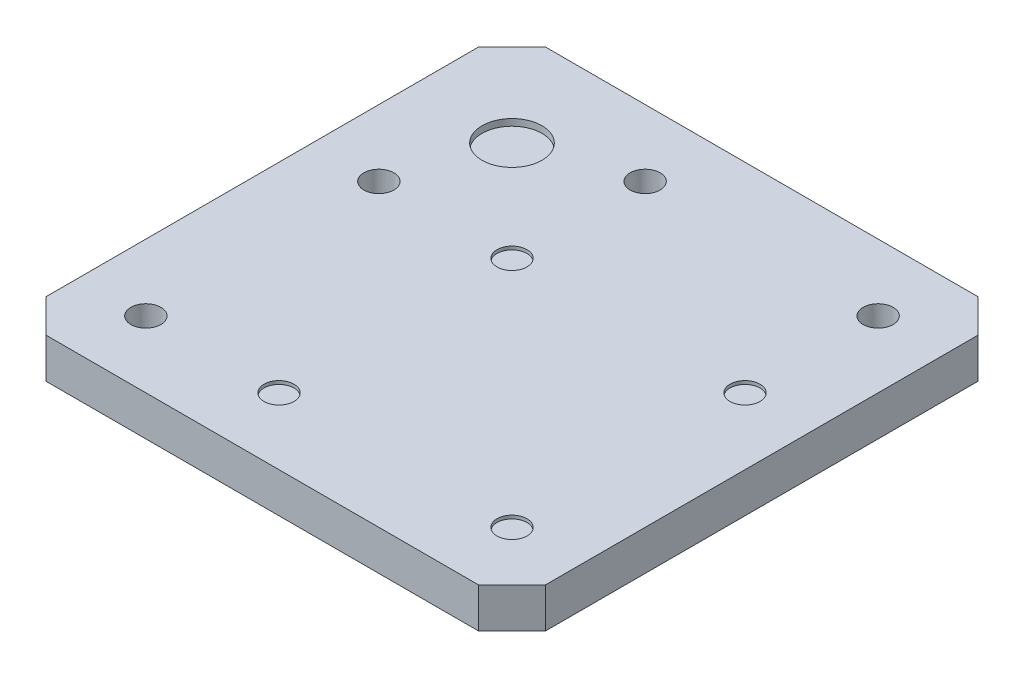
ISO-10303-21;
HEADER;
FILE_DESCRIPTION(('STEP AP214'),'2;1');
FILE_NAME('part.step','',(''),(''),'','','');
FILE_SCHEMA(('AUTOMOTIVE_DESIGN { 1 0 10303 214 1 1 1 1 }'));
ENDSEC;
DATA;
#1=APPLICATION_CONTEXT('core data for automotive mechanical design processes');
#2=APPLICATION_PROTOCOL_DEFINITION('international standard','automotive_design',2000,#1);
#3=PRODUCT_CONTEXT('',#1,'mechanical');
#4=PRODUCT('Part','Part','',(#3));
#5=PRODUCT_RELATED_PRODUCT_CATEGORY('part','',(#4));
#6=PRODUCT_DEFINITION_FORMATION('','',#4);
#7=PRODUCT_DEFINITION_CONTEXT('part definition',#1,'design');
#8=PRODUCT_DEFINITION('design','',#6,#7);
#9=PRODUCT_DEFINITION_SHAPE('','',#8);
#10=(LENGTH_UNIT() NAMED_UNIT(*) SI_UNIT(.MILLI.,.METRE.));
#11=(NAMED_UNIT(*) PLANE_ANGLE_UNIT() SI_UNIT($,.RADIAN.));
#12=(NAMED_UNIT(*) SI_UNIT($,.STERADIAN.) SOLID_ANGLE_UNIT());
#13=UNCERTAINTY_MEASURE_WITH_UNIT(LENGTH_MEASURE(1.E-05),#10,'distance_accuracy_value','');
#14=(GEOMETRIC_REPRESENTATION_CONTEXT(3) GLOBAL_UNCERTAINTY_ASSIGNED_CONTEXT((#13)) GLOBAL_UNIT_ASSIGNED_CONTEXT((#10,
#11,#12)) REPRESENTATION_CONTEXT('',''));
#15=CARTESIAN_POINT('',(0.,0.,0.));
#16=DIRECTION('',(0.,0.,1.));
#17=DIRECTION('',(1.,0.,0.));
#18=AXIS2_PLACEMENT_3D('',#15,#16,#17);
#19=CARTESIAN_POINT('',(-36.,-14.,-45.));
#20=DIRECTION('',(0.,1.,0.));
#21=DIRECTION('',(0.,0.,1.));
#22=AXIS2_PLACEMENT_3D('',#19,#20,#21);
#23=PLANE('',#22);
#24=CARTESIAN_POINT('',(-45.,-14.,-45.));
#25=DIRECTION('',(0.,1.,0.));
#26=DIRECTION('',(0.,0.,1.));
#27=AXIS2_PLACEMENT_3D('',#24,#25,#26);
#28=CIRCLE('',#27,8.99999999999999);
#29=CARTESIAN_POINT('',(-45.,-14.,-36.));
#30=VERTEX_POINT('',#29);
#31=EDGE_CURVE('E20',#30,#30,#28,.F.);
#32=ORIENTED_EDGE('',*,*,#31,.T.);
#33=EDGE_LOOP('',(#32));
#34=FACE_BOUND('',#33,.T.);
#35=ADVANCED_FACE('F17',(#34),#23,.F.);
#36=CARTESIAN_POINT('',(-45.,-64.25,-45.));
#37=DIRECTION('',(0.,1.,0.));
#38=DIRECTION('',(0.,0.,1.));
#39=AXIS2_PLACEMENT_3D('',#36,#37,#38);
#40=CYLINDRICAL_SURFACE('',#39,8.99999999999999);
#41=CARTESIAN_POINT('',(-45.,-64.25,-45.));
#42=DIRECTION('',(0.,1.,0.));
#43=DIRECTION('',(0.,0.,1.));
#44=AXIS2_PLACEMENT_3D('',#41,#42,#43);
#45=CIRCLE('',#44,8.99999999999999);
#46=CARTESIAN_POINT('',(-45.,-64.25,-36.));
#47=VERTEX_POINT('',#46);
#48=EDGE_CURVE('E171',#47,#47,#45,.F.);
#49=ORIENTED_EDGE('',*,*,#48,.T.);
#50=EDGE_LOOP('',(#49));
#51=FACE_BOUND('',#50,.T.);
#52=ORIENTED_EDGE('',*,*,#31,.F.);
#53=EDGE_LOOP('',(#52));
#54=FACE_BOUND('',#53,.T.);
#55=ADVANCED_FACE('F179',(#51,#54),#40,.F.);
#56=CARTESIAN_POINT('',(-30.,-64.25,-45.));
#57=DIRECTION('',(0.,1.,0.));
#58=DIRECTION('',(0.,0.,1.));
#59=AXIS2_PLACEMENT_3D('',#56,#57,#58);
#60=PLANE('',#59);
#61=ORIENTED_EDGE('',*,*,#48,.F.);
#62=EDGE_LOOP('',(#61));
#63=FACE_BOUND('',#62,.T.);
#64=CARTESIAN_POINT('',(-45.,-64.25,-45.));
#65=DIRECTION('',(0.,1.,0.));
#66=DIRECTION('',(0.,0.,1.));
#67=AXIS2_PLACEMENT_3D('',#64,#65,#66);
#68=CIRCLE('',#67,15.);
#69=CARTESIAN_POINT('',(-45.,-64.25,-30.));
#70=VERTEX_POINT('',#69);
#71=EDGE_CURVE('E114',#70,#70,#68,.T.);
#72=ORIENTED_EDGE('',*,*,#71,.F.);
#73=EDGE_LOOP('',(#72));
#74=FACE_BOUND('',#73,.T.);
#75=ADVANCED_FACE('F181',(#63,#74),#60,.F.);
#76=CARTESIAN_POINT('',(-45.,-61.25,-45.));
#77=DIRECTION('',(0.,1.,0.));
#78=DIRECTION('',(0.,0.,1.));
#79=AXIS2_PLACEMENT_3D('',#76,#77,#78);
#80=CONICAL_SURFACE('',#79,18.,0.785398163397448);
#81=ORIENTED_EDGE('',*,*,#71,.T.);
#82=EDGE_LOOP('',(#81));
#83=FACE_BOUND('',#82,.T.);
#84=CARTESIAN_POINT('',(-45.,-61.25,-45.));
#85=DIRECTION('',(0.,1.,0.));
#86=DIRECTION('',(0.,0.,1.));
#87=AXIS2_PLACEMENT_3D('',#84,#85,#86);
#88=CIRCLE('',#87,18.);
#89=CARTESIAN_POINT('',(-45.,-61.25,-27.));
#90=VERTEX_POINT('',#89);
#91=EDGE_CURVE('E112',#90,#90,#88,.T.);
#92=ORIENTED_EDGE('',*,*,#91,.F.);
#93=EDGE_LOOP('',(#92));
#94=FACE_BOUND('',#93,.T.);
#95=ADVANCED_FACE('F187',(#83,#94),#80,.T.);
#96=CARTESIAN_POINT('',(-45.,-64.25,-45.));
#97=DIRECTION('',(0.,1.,0.));
#98=DIRECTION('',(0.,0.,1.));
#99=AXIS2_PLACEMENT_3D('',#96,#97,#98);
#100=CYLINDRICAL_SURFACE('',#99,18.);
#101=ORIENTED_EDGE('',*,*,#91,.T.);
#102=EDGE_LOOP('',(#101));
#103=FACE_BOUND('',#102,.T.);
#104=CARTESIAN_POINT('',(-45.,-14.,-45.));
#105=DIRECTION('',(0.,1.,0.));
#106=DIRECTION('',(0.,0.,1.));
#107=AXIS2_PLACEMENT_3D('',#104,#105,#106);
#108=CIRCLE('',#107,18.);
#109=CARTESIAN_POINT('',(-45.,-14.,-27.));
#110=VERTEX_POINT('',#109);
#111=EDGE_CURVE('E108',#110,#110,#108,.T.);
#112=ORIENTED_EDGE('',*,*,#111,.F.);
#113=EDGE_LOOP('',(#112));
#114=FACE_BOUND('',#113,.T.);
#115=ADVANCED_FACE('F287',(#103,#114),#100,.T.);
#116=CARTESIAN_POINT('',(-45.,-12.,-45.));
#117=DIRECTION('',(0.,1.,0.));
#118=DIRECTION('',(-1.,0.,0.));
#119=AXIS2_PLACEMENT_3D('',#116,#117,#118);
#120=CONICAL_SURFACE('',#119,20.,0.785398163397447);
#121=ORIENTED_EDGE('',*,*,#111,.T.);
#122=EDGE_LOOP('',(#121));
#123=FACE_BOUND('',#122,.T.);
#124=CARTESIAN_POINT('',(-45.,-12.,-45.));
#125=DIRECTION('',(0.,1.,0.));
#126=DIRECTION('',(-1.,0.,0.));
#127=AXIS2_PLACEMENT_3D('',#124,#125,#126);
#128=CIRCLE('',#127,20.);
#129=CARTESIAN_POINT('',(-65.,-12.,-45.));
#130=VERTEX_POINT('',#129);
#131=EDGE_CURVE('E111',#130,#130,#128,.F.);
#132=ORIENTED_EDGE('',*,*,#131,.T.);
#133=EDGE_LOOP('',(#132));
#134=FACE_BOUND('',#133,.T.);
#135=ADVANCED_FACE('F283',(#123,#134),#120,.T.);
#136=CARTESIAN_POINT('',(0.,-1.,0.));
#137=DIRECTION('',(0.,1.,0.));
#138=DIRECTION('',(0.,0.,1.));
#139=AXIS2_PLACEMENT_3D('',#136,#137,#138);
#140=PLANE('',#139);
#141=CARTESIAN_POINT('',(-15.,-1.,-15.));
#142=DIRECTION('',(0.,-1.,0.));
#143=DIRECTION('',(0.,0.,-1.));
#144=AXIS2_PLACEMENT_3D('',#141,#142,#143);
#145=CIRCLE('',#144,4.5);
#146=CARTESIAN_POINT('',(-15.,-1.,-19.5));
#147=VERTEX_POINT('',#146);
#148=EDGE_CURVE('E162',#147,#147,#145,.F.);
#149=ORIENTED_EDGE('',*,*,#148,.T.);
#150=EDGE_LOOP('',(#149));
#151=FACE_BOUND('',#150,.T.);
#152=ADVANCED_FACE('F279',(#151),#140,.T.);
#153=CARTESIAN_POINT('',(0.,-1.,0.));
#154=DIRECTION('',(0.,1.,0.));
#155=DIRECTION('',(0.,0.,1.));
#156=AXIS2_PLACEMENT_3D('',#153,#154,#155);
#157=PLANE('',#156);
#158=CARTESIAN_POINT('',(55.,-1.,55.));
#159=DIRECTION('',(0.,-1.,0.));
#160=DIRECTION('',(0.,0.,-1.));
#161=AXIS2_PLACEMENT_3D('',#158,#159,#160);
#162=CIRCLE('',#161,4.5);
#163=CARTESIAN_POINT('',(55.,-1.,50.5));
#164=VERTEX_POINT('',#163);
#165=EDGE_CURVE('E93',#164,#164,#162,.F.);
#166=ORIENTED_EDGE('',*,*,#165,.T.);
#167=EDGE_LOOP('',(#166));
#168=FACE_BOUND('',#167,.T.);
#169=ADVANCED_FACE('F275',(#168),#157,.T.);
#170=CARTESIAN_POINT('',(0.,-1.,0.));
#171=DIRECTION('',(0.,1.,0.));
#172=DIRECTION('',(0.,0.,1.));
#173=AXIS2_PLACEMENT_3D('',#170,#171,#172);
#174=PLANE('',#173);
#175=CARTESIAN_POINT('',(55.,-1.,-15.));
#176=DIRECTION('',(0.,-1.,0.));
#177=DIRECTION('',(0.,0.,-1.));
#178=AXIS2_PLACEMENT_3D('',#175,#176,#177);
#179=CIRCLE('',#178,4.5);
#180=CARTESIAN_POINT('',(55.,-1.,-19.5));
#181=VERTEX_POINT('',#180);
#182=EDGE_CURVE('E150',#181,#181,#179,.F.);
#183=ORIENTED_EDGE('',*,*,#182,.T.);
#184=EDGE_LOOP('',(#183));
#185=FACE_BOUND('',#184,.T.);
#186=ADVANCED_FACE('F271',(#185),#174,.T.);
#187=CARTESIAN_POINT('',(0.,-1.,0.));
#188=DIRECTION('',(0.,1.,0.));
#189=DIRECTION('',(0.,0.,1.));
#190=AXIS2_PLACEMENT_3D('',#187,#188,#189);
#191=PLANE('',#190);
#192=CARTESIAN_POINT('',(-15.,-1.,55.));
#193=DIRECTION('',(0.,-1.,0.));
#194=DIRECTION('',(0.,0.,-1.));
#195=AXIS2_PLACEMENT_3D('',#192,#193,#194);
#196=CIRCLE('',#195,4.5);
#197=CARTESIAN_POINT('',(-15.,-1.,50.5));
#198=VERTEX_POINT('',#197);
#199=EDGE_CURVE('E147',#198,#198,#196,.F.);
#200=ORIENTED_EDGE('',*,*,#199,.T.);
#201=EDGE_LOOP('',(#200));
#202=FACE_BOUND('',#201,.T.);
#203=ADVANCED_FACE('F267',(#202),#191,.T.);
#204=CARTESIAN_POINT('',(-45.,-2.,-45.));
#205=DIRECTION('',(0.,-1.,0.));
#206=DIRECTION('',(0.,0.,-1.));
#207=AXIS2_PLACEMENT_3D('',#204,#205,#206);
#208=PLANE('',#207);
#209=CARTESIAN_POINT('',(-45.,-2.,-45.));
#210=DIRECTION('',(0.,1.,0.));
#211=DIRECTION('',(0.,0.,1.));
#212=AXIS2_PLACEMENT_3D('',#209,#210,#211);
#213=CIRCLE('',#212,9.);
#214=CARTESIAN_POINT('',(-45.,-2.,-36.));
#215=VERTEX_POINT('',#214);
#216=EDGE_CURVE('E144',#215,#215,#213,.T.);
#217=ORIENTED_EDGE('',*,*,#216,.T.);
#218=EDGE_LOOP('',(#217));
#219=FACE_BOUND('',#218,.T.);
#220=ADVANCED_FACE('F263',(#219),#208,.F.);
#221=CARTESIAN_POINT('',(0.,-12.,0.));
#222=DIRECTION('',(0.,1.,0.));
#223=DIRECTION('',(0.,0.,1.));
#224=AXIS2_PLACEMENT_3D('',#221,#222,#223);
#225=PLANE('',#224);
#226=ORIENTED_EDGE('',*,*,#131,.F.);
#227=EDGE_LOOP('',(#226));
#228=FACE_BOUND('',#227,.T.);
#229=CARTESIAN_POINT('',(-55.,-12.,-15.));
#230=DIRECTION('',(0.,1.,0.));
#231=DIRECTION('',(0.,0.,1.));
#232=AXIS2_PLACEMENT_3D('',#229,#230,#231);
#233=CIRCLE('',#232,4.5);
#234=CARTESIAN_POINT('',(-55.,-12.,-10.5));
#235=VERTEX_POINT('',#234);
#236=EDGE_CURVE('E141',#235,#235,#233,.T.);
#237=ORIENTED_EDGE('',*,*,#236,.T.);
#238=EDGE_LOOP('',(#237));
#239=FACE_BOUND('',#238,.T.);
#240=CARTESIAN_POINT('',(-55.,-12.,55.));
#241=DIRECTION('',(0.,1.,0.));
#242=DIRECTION('',(0.,0.,1.));
#243=AXIS2_PLACEMENT_3D('',#240,#241,#242);
#244=CIRCLE('',#243,4.5);
#245=CARTESIAN_POINT('',(-55.,-12.,59.5));
#246=VERTEX_POINT('',#245);
#247=EDGE_CURVE('E165',#246,#246,#244,.T.);
#248=ORIENTED_EDGE('',*,*,#247,.T.);
#249=EDGE_LOOP('',(#248));
#250=FACE_BOUND('',#249,.T.);
#251=CARTESIAN_POINT('',(-15.,-12.,-55.));
#252=DIRECTION('',(0.,1.,0.));
#253=DIRECTION('',(0.,0.,1.));
#254=AXIS2_PLACEMENT_3D('',#251,#252,#253);
#255=CIRCLE('',#254,4.5);
#256=CARTESIAN_POINT('',(-15.,-12.,-50.5));
#257=VERTEX_POINT('',#256);
#258=EDGE_CURVE('E159',#257,#257,#255,.T.);
#259=ORIENTED_EDGE('',*,*,#258,.T.);
#260=EDGE_LOOP('',(#259));
#261=FACE_BOUND('',#260,.T.);
#262=CARTESIAN_POINT('',(55.,-12.,-55.));
#263=DIRECTION('',(0.,1.,0.));
#264=DIRECTION('',(0.,0.,1.));
#265=AXIS2_PLACEMENT_3D('',#262,#263,#264);
#266=CIRCLE('',#265,4.5);
#267=CARTESIAN_POINT('',(55.,-12.,-50.5));
#268=VERTEX_POINT('',#267);
#269=EDGE_CURVE('E153',#268,#268,#266,.T.);
#270=ORIENTED_EDGE('',*,*,#269,.T.);
#271=EDGE_LOOP('',(#270));
#272=FACE_BOUND('',#271,.T.);
#273=DIRECTION('',(-1.,0.,0.));
#274=VECTOR('',#273,1.);
#275=CARTESIAN_POINT('',(65.,-12.,-75.));
#276=LINE('',#275,#274);
#277=CARTESIAN_POINT('',(65.,-12.,-75.));
#278=VERTEX_POINT('',#277);
#279=CARTESIAN_POINT('',(-65.,-12.,-75.));
#280=VERTEX_POINT('',#279);
#281=EDGE_CURVE('E156',#278,#280,#276,.T.);
#282=ORIENTED_EDGE('',*,*,#281,.F.);
#283=DIRECTION('',(-0.707106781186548,0.,-0.707106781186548));
#284=VECTOR('',#283,1.);
#285=CARTESIAN_POINT('',(75.,-12.,-65.));
#286=LINE('',#285,#284);
#287=CARTESIAN_POINT('',(75.,-12.,-65.));
#288=VERTEX_POINT('',#287);
#289=EDGE_CURVE('E538',#288,#278,#286,.T.);
#290=ORIENTED_EDGE('',*,*,#289,.F.);
#291=DIRECTION('',(0.,0.,-1.));
#292=VECTOR('',#291,1.);
#293=CARTESIAN_POINT('',(75.,-12.,65.));
#294=LINE('',#293,#292);
#295=CARTESIAN_POINT('',(75.,-12.,65.));
#296=VERTEX_POINT('',#295);
#297=EDGE_CURVE('E533',#296,#288,#294,.T.);
#298=ORIENTED_EDGE('',*,*,#297,.F.);
#299=DIRECTION('',(0.707106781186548,0.,-0.707106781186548));
#300=VECTOR('',#299,1.);
#301=CARTESIAN_POINT('',(65.,-12.,75.));
#302=LINE('',#301,#300);
#303=CARTESIAN_POINT('',(65.,-12.,75.));
#304=VERTEX_POINT('',#303);
#305=EDGE_CURVE('E528',#304,#296,#302,.T.);
#306=ORIENTED_EDGE('',*,*,#305,.F.);
#307=DIRECTION('',(1.,0.,0.));
#308=VECTOR('',#307,1.);
#309=CARTESIAN_POINT('',(-65.,-12.,75.));
#310=LINE('',#309,#308);
#311=CARTESIAN_POINT('',(-65.,-12.,75.));
#312=VERTEX_POINT('',#311);
#313=EDGE_CURVE('E523',#312,#304,#310,.T.);
#314=ORIENTED_EDGE('',*,*,#313,.F.);
#315=DIRECTION('',(0.707106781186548,0.,0.707106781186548));
#316=VECTOR('',#315,1.);
#317=CARTESIAN_POINT('',(-75.,-12.,65.));
#318=LINE('',#317,#316);
#319=CARTESIAN_POINT('',(-75.,-12.,65.));
#320=VERTEX_POINT('',#319);
#321=EDGE_CURVE('E97',#320,#312,#318,.T.);
#322=ORIENTED_EDGE('',*,*,#321,.F.);
#323=DIRECTION('',(0.,0.,1.));
#324=VECTOR('',#323,1.);
#325=CARTESIAN_POINT('',(-75.,-12.,-65.));
#326=LINE('',#325,#324);
#327=CARTESIAN_POINT('',(-75.,-12.,-65.));
#328=VERTEX_POINT('',#327);
#329=EDGE_CURVE('E79',#328,#320,#326,.T.);
#330=ORIENTED_EDGE('',*,*,#329,.F.);
#331=DIRECTION('',(-0.707106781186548,0.,0.707106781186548));
#332=VECTOR('',#331,1.);
#333=CARTESIAN_POINT('',(-65.,-12.,-75.));
#334=LINE('',#333,#332);
#335=EDGE_CURVE('E84',#280,#328,#334,.T.);
#336=ORIENTED_EDGE('',*,*,#335,.F.);
#337=EDGE_LOOP('',(#282,#290,#298,#306,#314,#322,#330,#336));
#338=FACE_BOUND('',#337,.T.);
#339=ADVANCED_FACE('F95',(#228,#239,#250,#261,#272,#338),#225,.F.);
#340=CARTESIAN_POINT('',(-55.,-12.,55.));
#341=DIRECTION('',(0.,1.,0.));
#342=DIRECTION('',(0.,0.,1.));
#343=AXIS2_PLACEMENT_3D('',#340,#341,#342);
#344=CYLINDRICAL_SURFACE('',#343,4.5);
#345=CARTESIAN_POINT('',(-55.,0.,55.));
#346=DIRECTION('',(0.,1.,0.));
#347=DIRECTION('',(0.,0.,1.));
#348=AXIS2_PLACEMENT_3D('',#345,#346,#347);
#349=CIRCLE('',#348,4.5);
#350=CARTESIAN_POINT('',(-55.,0.,59.5));
#351=VERTEX_POINT('',#350);
#352=EDGE_CURVE('E138',#351,#351,#349,.F.);
#353=ORIENTED_EDGE('',*,*,#352,.F.);
#354=EDGE_LOOP('',(#353));
#355=FACE_BOUND('',#354,.T.);
#356=ORIENTED_EDGE('',*,*,#247,.F.);
#357=EDGE_LOOP('',(#356));
#358=FACE_BOUND('',#357,.T.);
#359=ADVANCED_FACE('F256',(#355,#358),#344,.F.);
#360=CARTESIAN_POINT('',(-15.,0.,-15.));
#361=DIRECTION('',(0.,-1.,0.));
#362=DIRECTION('',(0.,0.,-1.));
#363=AXIS2_PLACEMENT_3D('',#360,#361,#362);
#364=CYLINDRICAL_SURFACE('',#363,4.5);
#365=CARTESIAN_POINT('',(-15.,0.,-15.));
#366=DIRECTION('',(0.,-1.,0.));
#367=DIRECTION('',(0.,0.,-1.));
#368=AXIS2_PLACEMENT_3D('',#365,#366,#367);
#369=CIRCLE('',#368,4.5);
#370=CARTESIAN_POINT('',(-15.,0.,-19.5));
#371=VERTEX_POINT('',#370);
#372=EDGE_CURVE('E135',#371,#371,#369,.T.);
#373=ORIENTED_EDGE('',*,*,#372,.F.);
#374=EDGE_LOOP('',(#373));
#375=FACE_BOUND('',#374,.T.);
#376=ORIENTED_EDGE('',*,*,#148,.F.);
#377=EDGE_LOOP('',(#376));
#378=FACE_BOUND('',#377,.T.);
#379=ADVANCED_FACE('F252',(#375,#378),#364,.F.);
#380=CARTESIAN_POINT('',(-15.,-12.,-55.));
#381=DIRECTION('',(0.,1.,0.));
#382=DIRECTION('',(0.,0.,1.));
#383=AXIS2_PLACEMENT_3D('',#380,#381,#382);
#384=CYLINDRICAL_SURFACE('',#383,4.5);
#385=CARTESIAN_POINT('',(-15.,0.,-55.));
#386=DIRECTION('',(0.,1.,0.));
#387=DIRECTION('',(0.,0.,1.));
#388=AXIS2_PLACEMENT_3D('',#385,#386,#387);
#389=CIRCLE('',#388,4.5);
#390=CARTESIAN_POINT('',(-15.,0.,-50.5));
#391=VERTEX_POINT('',#390);
#392=EDGE_CURVE('E132',#391,#391,#389,.F.);
#393=ORIENTED_EDGE('',*,*,#392,.F.);
#394=EDGE_LOOP('',(#393));
#395=FACE_BOUND('',#394,.T.);
#396=ORIENTED_EDGE('',*,*,#258,.F.);
#397=EDGE_LOOP('',(#396));
#398=FACE_BOUND('',#397,.T.);
#399=ADVANCED_FACE('F248',(#395,#398),#384,.F.);
#400=CARTESIAN_POINT('',(55.,0.,55.));
#401=DIRECTION('',(0.,-1.,0.));
#402=DIRECTION('',(0.,0.,-1.));
#403=AXIS2_PLACEMENT_3D('',#400,#401,#402);
#404=CYLINDRICAL_SURFACE('',#403,4.5);
#405=CARTESIAN_POINT('',(55.,0.,55.));
#406=DIRECTION('',(0.,-1.,0.));
#407=DIRECTION('',(0.,0.,-1.));
#408=AXIS2_PLACEMENT_3D('',#405,#406,#407);
#409=CIRCLE('',#408,4.5);
#410=CARTESIAN_POINT('',(55.,0.,50.5));
#411=VERTEX_POINT('',#410);
#412=EDGE_CURVE('E128',#411,#411,#409,.T.);
#413=ORIENTED_EDGE('',*,*,#412,.F.);
#414=EDGE_LOOP('',(#413));
#415=FACE_BOUND('',#414,.T.);
#416=ORIENTED_EDGE('',*,*,#165,.F.);
#417=EDGE_LOOP('',(#416));
#418=FACE_BOUND('',#417,.T.);
#419=ADVANCED_FACE('F245',(#415,#418),#404,.F.);
#420=CARTESIAN_POINT('',(-65.,-12.,-75.));
#421=DIRECTION('',(-0.707106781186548,0.,-0.707106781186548));
#422=DIRECTION('',(-0.707106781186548,0.,0.707106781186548));
#423=AXIS2_PLACEMENT_3D('',#420,#421,#422);
#424=PLANE('',#423);
#425=DIRECTION('',(0.,1.,0.));
#426=VECTOR('',#425,1.);
#427=CARTESIAN_POINT('',(-65.,-12.,-75.));
#428=LINE('',#427,#426);
#429=CARTESIAN_POINT('',(-65.,0.,-75.));
#430=VERTEX_POINT('',#429);
#431=EDGE_CURVE('E89',#280,#430,#428,.T.);
#432=ORIENTED_EDGE('',*,*,#431,.F.);
#433=ORIENTED_EDGE('',*,*,#335,.T.);
#434=DIRECTION('',(0.,1.,0.));
#435=VECTOR('',#434,1.);
#436=CARTESIAN_POINT('',(-75.,-12.,-65.));
#437=LINE('',#436,#435);
#438=CARTESIAN_POINT('',(-75.,0.,-65.));
#439=VERTEX_POINT('',#438);
#440=EDGE_CURVE('E86',#439,#328,#437,.F.);
#441=ORIENTED_EDGE('',*,*,#440,.F.);
#442=DIRECTION('',(-0.707106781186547,0.,0.707106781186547));
#443=VECTOR('',#442,1.);
#444=CARTESIAN_POINT('',(-65.,0.,-75.));
#445=LINE('',#444,#443);
#446=EDGE_CURVE('E131',#430,#439,#445,.T.);
#447=ORIENTED_EDGE('',*,*,#446,.F.);
#448=EDGE_LOOP('',(#432,#433,#441,#447));
#449=FACE_BOUND('',#448,.T.);
#450=ADVANCED_FACE('F85',(#449),#424,.T.);
#451=CARTESIAN_POINT('',(-75.,-12.,-65.));
#452=DIRECTION('',(-1.,0.,0.));
#453=DIRECTION('',(0.,0.,1.));
#454=AXIS2_PLACEMENT_3D('',#451,#452,#453);
#455=PLANE('',#454);
#456=ORIENTED_EDGE('',*,*,#440,.T.);
#457=ORIENTED_EDGE('',*,*,#329,.T.);
#458=DIRECTION('',(0.,1.,0.));
#459=VECTOR('',#458,1.);
#460=CARTESIAN_POINT('',(-75.,-12.,65.));
#461=LINE('',#460,#459);
#462=CARTESIAN_POINT('',(-75.,0.,65.));
#463=VERTEX_POINT('',#462);
#464=EDGE_CURVE('E99',#463,#320,#461,.F.);
#465=ORIENTED_EDGE('',*,*,#464,.F.);
#466=DIRECTION('',(0.,0.,1.));
#467=VECTOR('',#466,1.);
#468=CARTESIAN_POINT('',(-75.,0.,0.));
#469=LINE('',#468,#467);
#470=EDGE_CURVE('E103',#439,#463,#469,.T.);
#471=ORIENTED_EDGE('',*,*,#470,.F.);
#472=EDGE_LOOP('',(#456,#457,#465,#471));
#473=FACE_BOUND('',#472,.T.);
#474=ADVANCED_FACE('F101',(#473),#455,.T.);
#475=CARTESIAN_POINT('',(-75.,-12.,65.));
#476=DIRECTION('',(-0.707106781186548,0.,0.707106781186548));
#477=DIRECTION('',(0.707106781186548,0.,0.707106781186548));
#478=AXIS2_PLACEMENT_3D('',#475,#476,#477);
#479=PLANE('',#478);
#480=ORIENTED_EDGE('',*,*,#464,.T.);
#481=ORIENTED_EDGE('',*,*,#321,.T.);
#482=DIRECTION('',(0.,1.,0.));
#483=VECTOR('',#482,1.);
#484=CARTESIAN_POINT('',(-65.,-12.,75.));
#485=LINE('',#484,#483);
#486=CARTESIAN_POINT('',(-65.,0.,75.));
#487=VERTEX_POINT('',#486);
#488=EDGE_CURVE('E518',#487,#312,#485,.F.);
#489=ORIENTED_EDGE('',*,*,#488,.F.);
#490=DIRECTION('',(0.707106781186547,0.,0.707106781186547));
#491=VECTOR('',#490,1.);
#492=CARTESIAN_POINT('',(-75.,0.,65.));
#493=LINE('',#492,#491);
#494=EDGE_CURVE('E517',#463,#487,#493,.T.);
#495=ORIENTED_EDGE('',*,*,#494,.F.);
#496=EDGE_LOOP('',(#480,#481,#489,#495));
#497=FACE_BOUND('',#496,.T.);
#498=ADVANCED_FACE('F236',(#497),#479,.T.);
#499=CARTESIAN_POINT('',(-65.,-12.,75.));
#500=DIRECTION('',(0.,0.,1.));
#501=DIRECTION('',(1.,0.,0.));
#502=AXIS2_PLACEMENT_3D('',#499,#500,#501);
#503=PLANE('',#502);
#504=ORIENTED_EDGE('',*,*,#488,.T.);
#505=ORIENTED_EDGE('',*,*,#313,.T.);
#506=DIRECTION('',(0.,1.,0.));
#507=VECTOR('',#506,1.);
#508=CARTESIAN_POINT('',(65.,-12.,75.));
#509=LINE('',#508,#507);
#510=CARTESIAN_POINT('',(65.,0.,75.));
#511=VERTEX_POINT('',#510);
#512=EDGE_CURVE('E525',#511,#304,#509,.F.);
#513=ORIENTED_EDGE('',*,*,#512,.F.);
#514=DIRECTION('',(1.,0.,0.));
#515=VECTOR('',#514,1.);
#516=CARTESIAN_POINT('',(0.,0.,75.));
#517=LINE('',#516,#515);
#518=EDGE_CURVE('E546',#487,#511,#517,.T.);
#519=ORIENTED_EDGE('',*,*,#518,.F.);
#520=EDGE_LOOP('',(#504,#505,#513,#519));
#521=FACE_BOUND('',#520,.T.);
#522=ADVANCED_FACE('F232',(#521),#503,.T.);
#523=CARTESIAN_POINT('',(65.,-12.,75.));
#524=DIRECTION('',(0.707106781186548,0.,0.707106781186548));
#525=DIRECTION('',(0.707106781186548,0.,-0.707106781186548));
#526=AXIS2_PLACEMENT_3D('',#523,#524,#525);
#527=PLANE('',#526);
#528=ORIENTED_EDGE('',*,*,#512,.T.);
#529=ORIENTED_EDGE('',*,*,#305,.T.);
#530=DIRECTION('',(0.,1.,0.));
#531=VECTOR('',#530,1.);
#532=CARTESIAN_POINT('',(75.,-12.,65.));
#533=LINE('',#532,#531);
#534=CARTESIAN_POINT('',(75.,0.,65.));
#535=VERTEX_POINT('',#534);
#536=EDGE_CURVE('E530',#535,#296,#533,.F.);
#537=ORIENTED_EDGE('',*,*,#536,.F.);
#538=DIRECTION('',(0.707106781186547,0.,-0.707106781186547));
#539=VECTOR('',#538,1.);
#540=CARTESIAN_POINT('',(65.,0.,75.));
#541=LINE('',#540,#539);
#542=EDGE_CURVE('E549',#511,#535,#541,.T.);
#543=ORIENTED_EDGE('',*,*,#542,.F.);
#544=EDGE_LOOP('',(#528,#529,#537,#543));
#545=FACE_BOUND('',#544,.T.);
#546=ADVANCED_FACE('F228',(#545),#527,.T.);
#547=CARTESIAN_POINT('',(75.,-12.,65.));
#548=DIRECTION('',(1.,0.,0.));
#549=DIRECTION('',(0.,0.,-1.));
#550=AXIS2_PLACEMENT_3D('',#547,#548,#549);
#551=PLANE('',#550);
#552=ORIENTED_EDGE('',*,*,#536,.T.);
#553=ORIENTED_EDGE('',*,*,#297,.T.);
#554=DIRECTION('',(0.,1.,0.));
#555=VECTOR('',#554,1.);
#556=CARTESIAN_POINT('',(75.,-12.,-65.));
#557=LINE('',#556,#555);
#558=CARTESIAN_POINT('',(75.,0.,-65.));
#559=VERTEX_POINT('',#558);
#560=EDGE_CURVE('E535',#559,#288,#557,.F.);
#561=ORIENTED_EDGE('',*,*,#560,.F.);
#562=DIRECTION('',(0.,0.,1.));
#563=VECTOR('',#562,1.);
#564=CARTESIAN_POINT('',(75.,0.,0.));
#565=LINE('',#564,#563);
#566=EDGE_CURVE('E552',#535,#559,#565,.F.);
#567=ORIENTED_EDGE('',*,*,#566,.F.);
#568=EDGE_LOOP('',(#552,#553,#561,#567));
#569=FACE_BOUND('',#568,.T.);
#570=ADVANCED_FACE('F225',(#569),#551,.T.);
#571=CARTESIAN_POINT('',(75.,-12.,-65.));
#572=DIRECTION('',(0.707106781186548,0.,-0.707106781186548));
#573=DIRECTION('',(-0.707106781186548,0.,-0.707106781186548));
#574=AXIS2_PLACEMENT_3D('',#571,#572,#573);
#575=PLANE('',#574);
#576=ORIENTED_EDGE('',*,*,#560,.T.);
#577=ORIENTED_EDGE('',*,*,#289,.T.);
#578=DIRECTION('',(0.,1.,0.));
#579=VECTOR('',#578,1.);
#580=CARTESIAN_POINT('',(65.,-12.,-75.));
#581=LINE('',#580,#579);
#582=CARTESIAN_POINT('',(65.,0.,-75.));
#583=VERTEX_POINT('',#582);
#584=EDGE_CURVE('E35',#583,#278,#581,.F.);
#585=ORIENTED_EDGE('',*,*,#584,.F.);
#586=DIRECTION('',(-0.707106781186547,0.,-0.707106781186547));
#587=VECTOR('',#586,1.);
#588=CARTESIAN_POINT('',(75.,0.,-65.));
#589=LINE('',#588,#587);
#590=EDGE_CURVE('E555',#559,#583,#589,.T.);
#591=ORIENTED_EDGE('',*,*,#590,.F.);
#592=EDGE_LOOP('',(#576,#577,#585,#591));
#593=FACE_BOUND('',#592,.T.);
#594=ADVANCED_FACE('F221',(#593),#575,.T.);
#595=CARTESIAN_POINT('',(65.,-12.,-75.));
#596=DIRECTION('',(0.,0.,-1.));
#597=DIRECTION('',(-1.,0.,0.));
#598=AXIS2_PLACEMENT_3D('',#595,#596,#597);
#599=PLANE('',#598);
#600=ORIENTED_EDGE('',*,*,#584,.T.);
#601=ORIENTED_EDGE('',*,*,#281,.T.);
#602=ORIENTED_EDGE('',*,*,#431,.T.);
#603=DIRECTION('',(1.,0.,0.));
#604=VECTOR('',#603,1.);
#605=CARTESIAN_POINT('',(0.,0.,-75.));
#606=LINE('',#605,#604);
#607=EDGE_CURVE('E127',#583,#430,#606,.F.);
#608=ORIENTED_EDGE('',*,*,#607,.F.);
#609=EDGE_LOOP('',(#600,#601,#602,#608));
#610=FACE_BOUND('',#609,.T.);
#611=ADVANCED_FACE('F217',(#610),#599,.T.);
#612=CARTESIAN_POINT('',(55.,-12.,-55.));
#613=DIRECTION('',(0.,1.,0.));
#614=DIRECTION('',(0.,0.,1.));
#615=AXIS2_PLACEMENT_3D('',#612,#613,#614);
#616=CYLINDRICAL_SURFACE('',#615,4.5);
#617=CARTESIAN_POINT('',(55.,0.,-55.));
#618=DIRECTION('',(0.,1.,0.));
#619=DIRECTION('',(0.,0.,1.));
#620=AXIS2_PLACEMENT_3D('',#617,#618,#619);
#621=CIRCLE('',#620,4.5);
#622=CARTESIAN_POINT('',(55.,0.,-50.5));
#623=VERTEX_POINT('',#622);
#624=EDGE_CURVE('E124',#623,#623,#621,.F.);
#625=ORIENTED_EDGE('',*,*,#624,.F.);
#626=EDGE_LOOP('',(#625));
#627=FACE_BOUND('',#626,.T.);
#628=ORIENTED_EDGE('',*,*,#269,.F.);
#629=EDGE_LOOP('',(#628));
#630=FACE_BOUND('',#629,.T.);
#631=ADVANCED_FACE('F213',(#627,#630),#616,.F.);
#632=CARTESIAN_POINT('',(55.,0.,-15.));
#633=DIRECTION('',(0.,-1.,0.));
#634=DIRECTION('',(0.,0.,-1.));
#635=AXIS2_PLACEMENT_3D('',#632,#633,#634);
#636=CYLINDRICAL_SURFACE('',#635,4.5);
#637=CARTESIAN_POINT('',(55.,0.,-15.));
#638=DIRECTION('',(0.,-1.,0.));
#639=DIRECTION('',(0.,0.,-1.));
#640=AXIS2_PLACEMENT_3D('',#637,#638,#639);
#641=CIRCLE('',#640,4.5);
#642=CARTESIAN_POINT('',(55.,0.,-19.5));
#643=VERTEX_POINT('',#642);
#644=EDGE_CURVE('E121',#643,#643,#641,.T.);
#645=ORIENTED_EDGE('',*,*,#644,.F.);
#646=EDGE_LOOP('',(#645));
#647=FACE_BOUND('',#646,.T.);
#648=ORIENTED_EDGE('',*,*,#182,.F.);
#649=EDGE_LOOP('',(#648));
#650=FACE_BOUND('',#649,.T.);
#651=ADVANCED_FACE('F209',(#647,#650),#636,.F.);
#652=CARTESIAN_POINT('',(-15.,0.,55.));
#653=DIRECTION('',(0.,-1.,0.));
#654=DIRECTION('',(0.,0.,-1.));
#655=AXIS2_PLACEMENT_3D('',#652,#653,#654);
#656=CYLINDRICAL_SURFACE('',#655,4.5);
#657=CARTESIAN_POINT('',(-15.,0.,55.));
#658=DIRECTION('',(0.,-1.,0.));
#659=DIRECTION('',(0.,0.,-1.));
#660=AXIS2_PLACEMENT_3D('',#657,#658,#659);
#661=CIRCLE('',#660,4.5);
#662=CARTESIAN_POINT('',(-15.,0.,50.5));
#663=VERTEX_POINT('',#662);
#664=EDGE_CURVE('E118',#663,#663,#661,.T.);
#665=ORIENTED_EDGE('',*,*,#664,.F.);
#666=EDGE_LOOP('',(#665));
#667=FACE_BOUND('',#666,.T.);
#668=ORIENTED_EDGE('',*,*,#199,.F.);
#669=EDGE_LOOP('',(#668));
#670=FACE_BOUND('',#669,.T.);
#671=ADVANCED_FACE('F205',(#667,#670),#656,.F.);
#672=CARTESIAN_POINT('',(-45.,-12.,-45.));
#673=DIRECTION('',(0.,1.,0.));
#674=DIRECTION('',(0.,0.,1.));
#675=AXIS2_PLACEMENT_3D('',#672,#673,#674);
#676=CYLINDRICAL_SURFACE('',#675,9.);
#677=CARTESIAN_POINT('',(-45.,0.,-45.));
#678=DIRECTION('',(0.,1.,0.));
#679=DIRECTION('',(0.,0.,1.));
#680=AXIS2_PLACEMENT_3D('',#677,#678,#679);
#681=CIRCLE('',#680,9.);
#682=CARTESIAN_POINT('',(-45.,0.,-36.));
#683=VERTEX_POINT('',#682);
#684=EDGE_CURVE('E26',#683,#683,#681,.F.);
#685=ORIENTED_EDGE('',*,*,#684,.F.);
#686=EDGE_LOOP('',(#685));
#687=FACE_BOUND('',#686,.T.);
#688=ORIENTED_EDGE('',*,*,#216,.F.);
#689=EDGE_LOOP('',(#688));
#690=FACE_BOUND('',#689,.T.);
#691=ADVANCED_FACE('F198',(#687,#690),#676,.F.);
#692=CARTESIAN_POINT('',(-55.,-12.,-15.));
#693=DIRECTION('',(0.,1.,0.));
#694=DIRECTION('',(0.,0.,1.));
#695=AXIS2_PLACEMENT_3D('',#692,#693,#694);
#696=CYLINDRICAL_SURFACE('',#695,4.5);
#697=CARTESIAN_POINT('',(-55.,0.,-15.));
#698=DIRECTION('',(0.,1.,0.));
#699=DIRECTION('',(0.,0.,1.));
#700=AXIS2_PLACEMENT_3D('',#697,#698,#699);
#701=CIRCLE('',#700,4.5);
#702=CARTESIAN_POINT('',(-55.,0.,-10.5));
#703=VERTEX_POINT('',#702);
#704=EDGE_CURVE('E11',#703,#703,#701,.F.);
#705=ORIENTED_EDGE('',*,*,#704,.F.);
#706=EDGE_LOOP('',(#705));
#707=FACE_BOUND('',#706,.T.);
#708=ORIENTED_EDGE('',*,*,#236,.F.);
#709=EDGE_LOOP('',(#708));
#710=FACE_BOUND('',#709,.T.);
#711=ADVANCED_FACE('F192',(#707,#710),#696,.F.);
#712=CARTESIAN_POINT('',(0.,0.,0.));
#713=DIRECTION('',(0.,1.,0.));
#714=DIRECTION('',(0.,0.,1.));
#715=AXIS2_PLACEMENT_3D('',#712,#713,#714);
#716=PLANE('',#715);
#717=ORIENTED_EDGE('',*,*,#704,.T.);
#718=EDGE_LOOP('',(#717));
#719=FACE_BOUND('',#718,.T.);
#720=ORIENTED_EDGE('',*,*,#684,.T.);
#721=EDGE_LOOP('',(#720));
#722=FACE_BOUND('',#721,.T.);
#723=ORIENTED_EDGE('',*,*,#664,.T.);
#724=EDGE_LOOP('',(#723));
#725=FACE_BOUND('',#724,.T.);
#726=ORIENTED_EDGE('',*,*,#644,.T.);
#727=EDGE_LOOP('',(#726));
#728=FACE_BOUND('',#727,.T.);
#729=ORIENTED_EDGE('',*,*,#624,.T.);
#730=EDGE_LOOP('',(#729));
#731=FACE_BOUND('',#730,.T.);
#732=ORIENTED_EDGE('',*,*,#590,.T.);
#733=ORIENTED_EDGE('',*,*,#607,.T.);
#734=ORIENTED_EDGE('',*,*,#446,.T.);
#735=ORIENTED_EDGE('',*,*,#470,.T.);
#736=ORIENTED_EDGE('',*,*,#494,.T.);
#737=ORIENTED_EDGE('',*,*,#518,.T.);
#738=ORIENTED_EDGE('',*,*,#542,.T.);
#739=ORIENTED_EDGE('',*,*,#566,.T.);
#740=EDGE_LOOP('',(#732,#733,#734,#735,#736,#737,#738,#739));
#741=FACE_BOUND('',#740,.T.);
#742=ORIENTED_EDGE('',*,*,#412,.T.);
#743=EDGE_LOOP('',(#742));
#744=FACE_BOUND('',#743,.T.);
#745=ORIENTED_EDGE('',*,*,#392,.T.);
#746=EDGE_LOOP('',(#745));
#747=FACE_BOUND('',#746,.T.);
#748=ORIENTED_EDGE('',*,*,#372,.T.);
#749=EDGE_LOOP('',(#748));
#750=FACE_BOUND('',#749,.T.);
#751=ORIENTED_EDGE('',*,*,#352,.T.);
#752=EDGE_LOOP('',(#751));
#753=FACE_BOUND('',#752,.T.);
#754=ADVANCED_FACE('F190',(#719,#722,#725,#728,#731,#741,#744,#747,#750,#753),#716,.T.);
#755=CLOSED_SHELL('',(#35,#55,#75,#95,#115,#135,#152,#169,#186,#203,#220,#339,#359,#379,#399,
#419,#450,#474,#498,#522,#546,#570,#594,#611,#631,#651,#671,#691,#711,#754));
#756=MANIFOLD_SOLID_BREP('B1',#755);
#757=ADVANCED_BREP_SHAPE_REPRESENTATION('',(#18,#756),#14);
#758=SHAPE_DEFINITION_REPRESENTATION(#9,#757);
ENDSEC;
END-ISO-10303-21;
